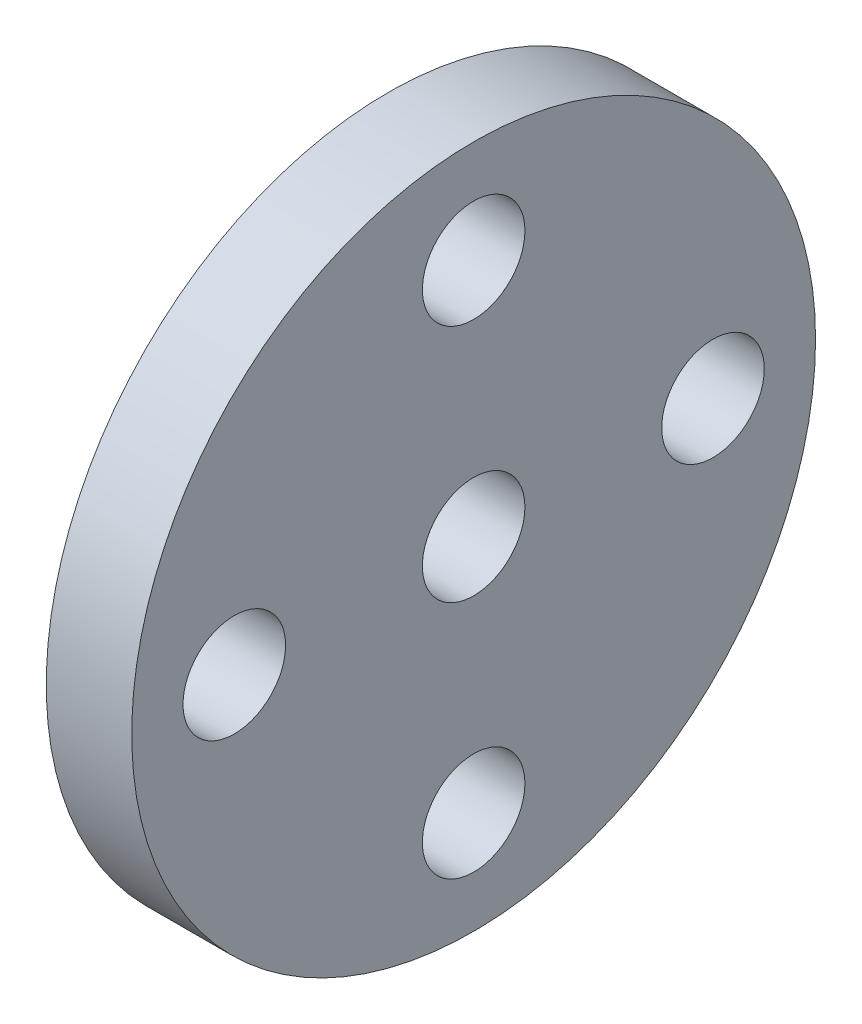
from build123d import *

# Parameters (mm, degrees)
SKETCH_4_R      = 10
SKETCH_4_R_2    = 1.5
EXTRUDE_2_DEPTH = 2.5
SKETCH_12_R     = 4.5
SKETCH_12_R_2   = 3
EXTRUDE_5_DEPTH = 1.5


with BuildPart() as part:
    # Sketch 4 → Extrude 2 (new body)
    with BuildSketch(Plane(origin=(0, 0, 0), x_dir=(0, 0, -1), z_dir=(1, 0, 0))):
        Circle(SKETCH_4_R)
        with Locations((0.000723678, 7)):
            Circle(SKETCH_4_R_2, mode=Mode.SUBTRACT)
        with Locations((-7, 0)):
            Circle(SKETCH_4_R_2, mode=Mode.SUBTRACT)
        Circle(SKETCH_4_R_2, mode=Mode.SUBTRACT)
        with Locations((0, -7)):
            Circle(SKETCH_4_R_2, mode=Mode.SUBTRACT)
        with Locations((7, 0)):
            Circle(SKETCH_4_R_2, mode=Mode.SUBTRACT)
    extrude(amount=EXTRUDE_2_DEPTH)

    # Sketch 12 → Extrude 5 (add)
    with BuildSketch(Plane(origin=(0, 0, 0), x_dir=(0, 0, -1), z_dir=(1, 0, 0))):
        Circle(SKETCH_12_R)
        Circle(SKETCH_12_R_2, mode=Mode.SUBTRACT)
    extrude(amount=-EXTRUDE_5_DEPTH)


solid = part.part
